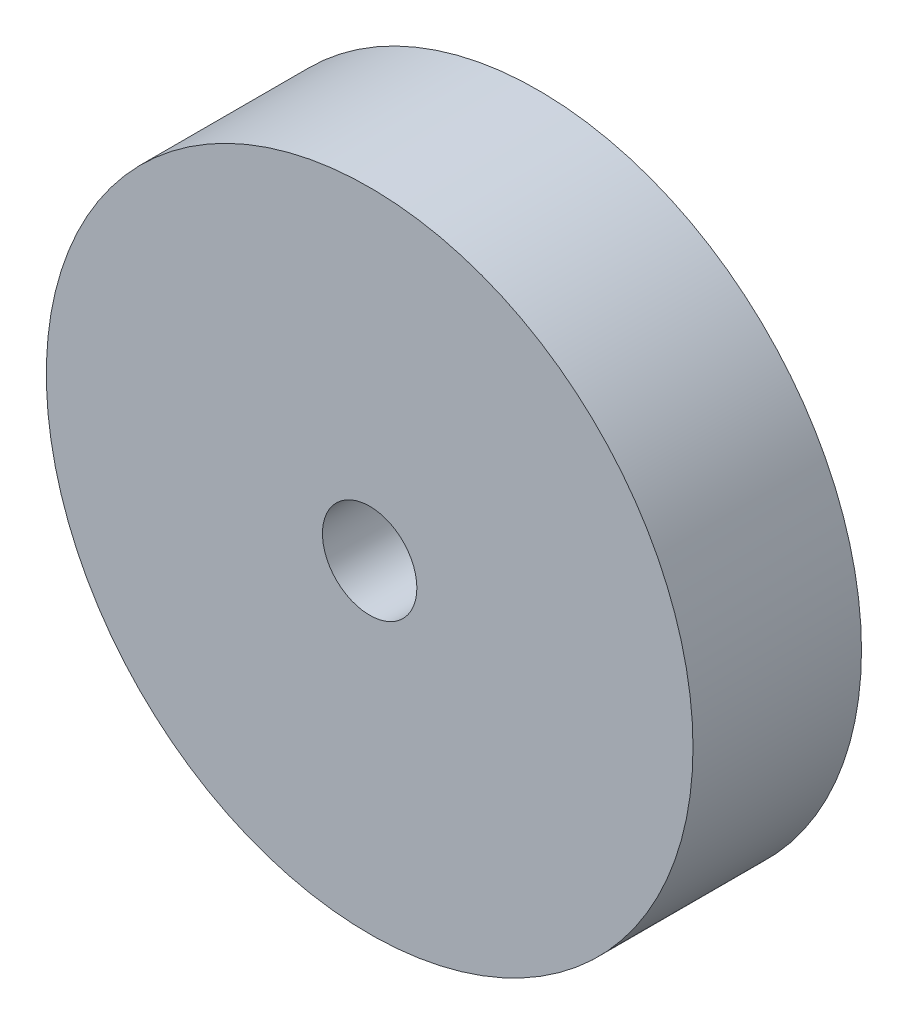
ISO-10303-21;
HEADER;
FILE_DESCRIPTION(('STEP AP214'),'2;1');
FILE_NAME('part.step','',(''),(''),'','','');
FILE_SCHEMA(('AUTOMOTIVE_DESIGN { 1 0 10303 214 1 1 1 1 }'));
ENDSEC;
DATA;
#1=APPLICATION_CONTEXT('core data for automotive mechanical design processes');
#2=APPLICATION_PROTOCOL_DEFINITION('international standard','automotive_design',2000,#1);
#3=PRODUCT_CONTEXT('',#1,'mechanical');
#4=PRODUCT('Part','Part','',(#3));
#5=PRODUCT_RELATED_PRODUCT_CATEGORY('part','',(#4));
#6=PRODUCT_DEFINITION_FORMATION('','',#4);
#7=PRODUCT_DEFINITION_CONTEXT('part definition',#1,'design');
#8=PRODUCT_DEFINITION('design','',#6,#7);
#9=PRODUCT_DEFINITION_SHAPE('','',#8);
#10=(LENGTH_UNIT() NAMED_UNIT(*) SI_UNIT(.MILLI.,.METRE.));
#11=(NAMED_UNIT(*) PLANE_ANGLE_UNIT() SI_UNIT($,.RADIAN.));
#12=(NAMED_UNIT(*) SI_UNIT($,.STERADIAN.) SOLID_ANGLE_UNIT());
#13=UNCERTAINTY_MEASURE_WITH_UNIT(LENGTH_MEASURE(1.E-05),#10,'distance_accuracy_value','');
#14=(GEOMETRIC_REPRESENTATION_CONTEXT(3) GLOBAL_UNCERTAINTY_ASSIGNED_CONTEXT((#13)) GLOBAL_UNIT_ASSIGNED_CONTEXT((#10,
#11,#12)) REPRESENTATION_CONTEXT('',''));
#15=CARTESIAN_POINT('',(0.,0.,0.));
#16=DIRECTION('',(0.,0.,1.));
#17=DIRECTION('',(1.,0.,0.));
#18=AXIS2_PLACEMENT_3D('',#15,#16,#17);
#19=CARTESIAN_POINT('',(0.,34.925,9.1));
#20=DIRECTION('',(0.,0.,-1.));
#21=DIRECTION('',(-1.,0.,0.));
#22=AXIS2_PLACEMENT_3D('',#19,#20,#21);
#23=PLANE('',#22);
#24=CARTESIAN_POINT('',(0.,0.,9.1));
#25=DIRECTION('',(0.,0.,1.));
#26=DIRECTION('',(1.,0.,0.));
#27=AXIS2_PLACEMENT_3D('',#24,#25,#26);
#28=CIRCLE('',#27,5.1);
#29=CARTESIAN_POINT('',(5.1,0.,9.1));
#30=VERTEX_POINT('',#29);
#31=EDGE_CURVE('E41',#30,#30,#28,.T.);
#32=ORIENTED_EDGE('',*,*,#31,.F.);
#33=EDGE_LOOP('',(#32));
#34=FACE_BOUND('',#33,.T.);
#35=CARTESIAN_POINT('',(0.,0.,9.1));
#36=DIRECTION('',(0.,0.,1.));
#37=DIRECTION('',(1.,0.,0.));
#38=AXIS2_PLACEMENT_3D('',#35,#36,#37);
#39=CIRCLE('',#38,34.925);
#40=CARTESIAN_POINT('',(34.925,0.,9.1));
#41=VERTEX_POINT('',#40);
#42=EDGE_CURVE('E37',#41,#41,#39,.T.);
#43=ORIENTED_EDGE('',*,*,#42,.T.);
#44=EDGE_LOOP('',(#43));
#45=FACE_BOUND('',#44,.T.);
#46=ADVANCED_FACE('F31',(#34,#45),#23,.F.);
#47=CARTESIAN_POINT('',(0.,34.925,-9.1));
#48=DIRECTION('',(0.,0.,1.));
#49=DIRECTION('',(1.,0.,0.));
#50=AXIS2_PLACEMENT_3D('',#47,#48,#49);
#51=PLANE('',#50);
#52=CARTESIAN_POINT('',(0.,0.,-9.1));
#53=DIRECTION('',(0.,0.,1.));
#54=DIRECTION('',(1.,0.,0.));
#55=AXIS2_PLACEMENT_3D('',#52,#53,#54);
#56=CIRCLE('',#55,5.1);
#57=CARTESIAN_POINT('',(5.1,0.,-9.1));
#58=VERTEX_POINT('',#57);
#59=EDGE_CURVE('E45',#58,#58,#56,.T.);
#60=ORIENTED_EDGE('',*,*,#59,.T.);
#61=EDGE_LOOP('',(#60));
#62=FACE_BOUND('',#61,.T.);
#63=CARTESIAN_POINT('',(0.,0.,-9.1));
#64=DIRECTION('',(0.,0.,1.));
#65=DIRECTION('',(1.,0.,0.));
#66=AXIS2_PLACEMENT_3D('',#63,#64,#65);
#67=CIRCLE('',#66,34.925);
#68=CARTESIAN_POINT('',(34.925,0.,-9.1));
#69=VERTEX_POINT('',#68);
#70=EDGE_CURVE('E10',#69,#69,#67,.T.);
#71=ORIENTED_EDGE('',*,*,#70,.F.);
#72=EDGE_LOOP('',(#71));
#73=FACE_BOUND('',#72,.T.);
#74=ADVANCED_FACE('F51',(#62,#73),#51,.F.);
#75=CARTESIAN_POINT('',(0.,0.,0.));
#76=DIRECTION('',(0.,0.,1.));
#77=DIRECTION('',(1.,0.,0.));
#78=AXIS2_PLACEMENT_3D('',#75,#76,#77);
#79=CYLINDRICAL_SURFACE('',#78,34.925);
#80=ORIENTED_EDGE('',*,*,#42,.F.);
#81=EDGE_LOOP('',(#80));
#82=FACE_BOUND('',#81,.T.);
#83=ORIENTED_EDGE('',*,*,#70,.T.);
#84=EDGE_LOOP('',(#83));
#85=FACE_BOUND('',#84,.T.);
#86=ADVANCED_FACE('F57',(#82,#85),#79,.T.);
#87=CARTESIAN_POINT('',(0.,0.,9.1));
#88=DIRECTION('',(0.,0.,1.));
#89=DIRECTION('',(1.,0.,0.));
#90=AXIS2_PLACEMENT_3D('',#87,#88,#89);
#91=CYLINDRICAL_SURFACE('',#90,5.1);
#92=ORIENTED_EDGE('',*,*,#59,.F.);
#93=EDGE_LOOP('',(#92));
#94=FACE_BOUND('',#93,.T.);
#95=ORIENTED_EDGE('',*,*,#31,.T.);
#96=EDGE_LOOP('',(#95));
#97=FACE_BOUND('',#96,.T.);
#98=ADVANCED_FACE('F54',(#94,#97),#91,.F.);
#99=CLOSED_SHELL('',(#46,#74,#86,#98));
#100=MANIFOLD_SOLID_BREP('B2',#99);
#101=ADVANCED_BREP_SHAPE_REPRESENTATION('',(#18,#100),#14);
#102=SHAPE_DEFINITION_REPRESENTATION(#9,#101);
ENDSEC;
END-ISO-10303-21;
